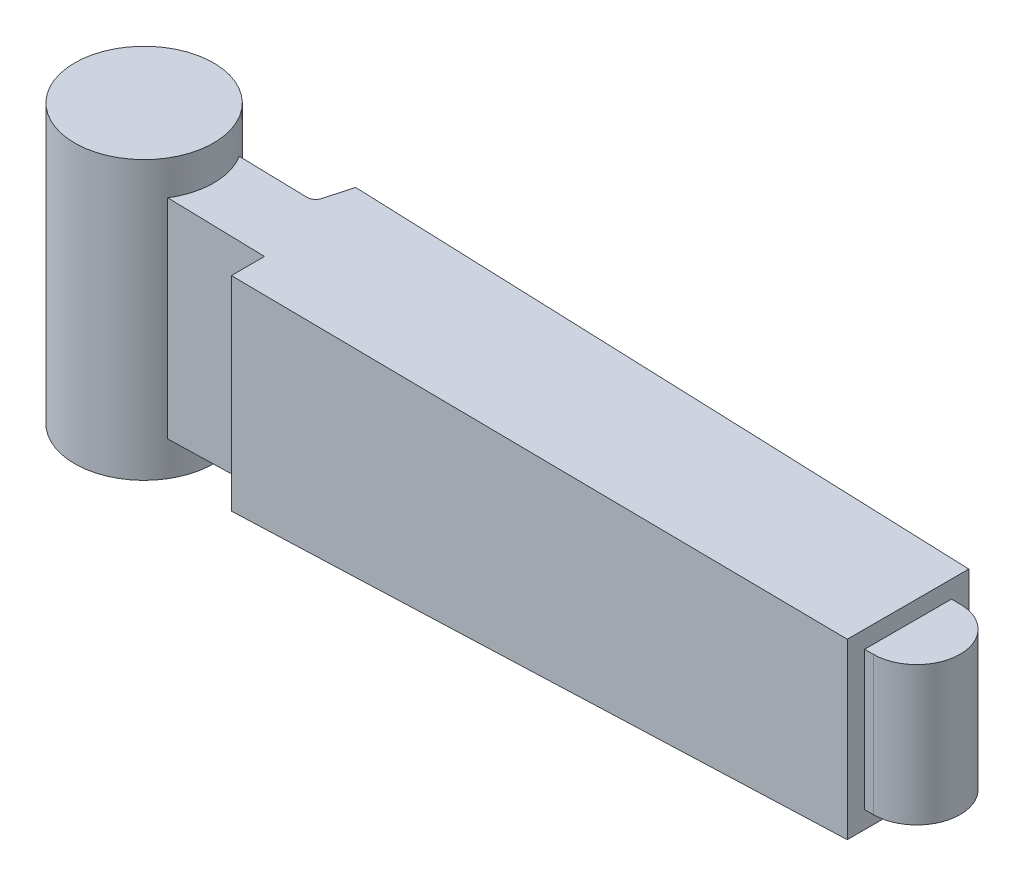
ISO-10303-21;
HEADER;
FILE_DESCRIPTION(('STEP AP214'),'2;1');
FILE_NAME('part.step','',(''),(''),'','','');
FILE_SCHEMA(('AUTOMOTIVE_DESIGN { 1 0 10303 214 1 1 1 1 }'));
ENDSEC;
DATA;
#1=APPLICATION_CONTEXT('core data for automotive mechanical design processes');
#2=APPLICATION_PROTOCOL_DEFINITION('international standard','automotive_design',2000,#1);
#3=PRODUCT_CONTEXT('',#1,'mechanical');
#4=PRODUCT('Part','Part','',(#3));
#5=PRODUCT_RELATED_PRODUCT_CATEGORY('part','',(#4));
#6=PRODUCT_DEFINITION_FORMATION('','',#4);
#7=PRODUCT_DEFINITION_CONTEXT('part definition',#1,'design');
#8=PRODUCT_DEFINITION('design','',#6,#7);
#9=PRODUCT_DEFINITION_SHAPE('','',#8);
#10=(LENGTH_UNIT() NAMED_UNIT(*) SI_UNIT(.MILLI.,.METRE.));
#11=(NAMED_UNIT(*) PLANE_ANGLE_UNIT() SI_UNIT($,.RADIAN.));
#12=(NAMED_UNIT(*) SI_UNIT($,.STERADIAN.) SOLID_ANGLE_UNIT());
#13=UNCERTAINTY_MEASURE_WITH_UNIT(LENGTH_MEASURE(1.E-05),#10,'distance_accuracy_value','');
#14=(GEOMETRIC_REPRESENTATION_CONTEXT(3) GLOBAL_UNCERTAINTY_ASSIGNED_CONTEXT((#13)) GLOBAL_UNIT_ASSIGNED_CONTEXT((#10,
#11,#12)) REPRESENTATION_CONTEXT('',''));
#15=CARTESIAN_POINT('',(0.,0.,0.));
#16=DIRECTION('',(0.,0.,1.));
#17=DIRECTION('',(1.,0.,0.));
#18=AXIS2_PLACEMENT_3D('',#15,#16,#17);
#19=CARTESIAN_POINT('',(44.,5.,-4.065));
#20=DIRECTION('',(-1.,0.,0.));
#21=DIRECTION('',(0.,0.,1.));
#22=AXIS2_PLACEMENT_3D('',#19,#20,#21);
#23=PLANE('',#22);
#24=DIRECTION('',(0.,0.,1.));
#25=VECTOR('',#24,1.);
#26=CARTESIAN_POINT('',(44.,5.,-4.065));
#27=LINE('',#26,#25);
#28=CARTESIAN_POINT('',(44.,5.,-3.5));
#29=VERTEX_POINT('',#28);
#30=CARTESIAN_POINT('',(44.,5.,3.5));
#31=VERTEX_POINT('',#30);
#32=EDGE_CURVE('E186',#29,#31,#27,.T.);
#33=ORIENTED_EDGE('',*,*,#32,.T.);
#34=DIRECTION('',(0.,1.,0.));
#35=VECTOR('',#34,1.);
#36=CARTESIAN_POINT('',(44.,-9.065,3.5));
#37=LINE('',#36,#35);
#38=CARTESIAN_POINT('',(44.,-5.,3.5));
#39=VERTEX_POINT('',#38);
#40=EDGE_CURVE('E225',#39,#31,#37,.T.);
#41=ORIENTED_EDGE('',*,*,#40,.F.);
#42=DIRECTION('',(0.,0.,1.));
#43=VECTOR('',#42,1.);
#44=CARTESIAN_POINT('',(44.,-5.,-4.065));
#45=LINE('',#44,#43);
#46=CARTESIAN_POINT('',(44.,-5.,-3.5));
#47=VERTEX_POINT('',#46);
#48=EDGE_CURVE('E183',#47,#39,#45,.T.);
#49=ORIENTED_EDGE('',*,*,#48,.F.);
#50=DIRECTION('',(0.,1.,0.));
#51=VECTOR('',#50,1.);
#52=CARTESIAN_POINT('',(44.,-9.065,-3.5));
#53=LINE('',#52,#51);
#54=EDGE_CURVE('E222',#47,#29,#53,.T.);
#55=ORIENTED_EDGE('',*,*,#54,.T.);
#56=EDGE_LOOP('',(#33,#41,#49,#55));
#57=FACE_BOUND('',#56,.T.);
#58=DIRECTION('',(0.,-1.,0.));
#59=VECTOR('',#58,1.);
#60=CARTESIAN_POINT('',(44.,4.,2.5));
#61=LINE('',#60,#59);
#62=CARTESIAN_POINT('',(44.,4.,2.5));
#63=VERTEX_POINT('',#62);
#64=CARTESIAN_POINT('',(44.,-4.,2.5));
#65=VERTEX_POINT('',#64);
#66=EDGE_CURVE('E241',#63,#65,#61,.T.);
#67=ORIENTED_EDGE('',*,*,#66,.F.);
#68=DIRECTION('',(0.,0.,1.));
#69=VECTOR('',#68,1.);
#70=CARTESIAN_POINT('',(44.,4.,-2.5));
#71=LINE('',#70,#69);
#72=CARTESIAN_POINT('',(44.,4.,-2.5));
#73=VERTEX_POINT('',#72);
#74=EDGE_CURVE('E259',#73,#63,#71,.T.);
#75=ORIENTED_EDGE('',*,*,#74,.F.);
#76=DIRECTION('',(0.,-1.,0.));
#77=VECTOR('',#76,1.);
#78=CARTESIAN_POINT('',(44.,4.,-2.5));
#79=LINE('',#78,#77);
#80=CARTESIAN_POINT('',(44.,-4.,-2.5));
#81=VERTEX_POINT('',#80);
#82=EDGE_CURVE('E247',#73,#81,#79,.T.);
#83=ORIENTED_EDGE('',*,*,#82,.T.);
#84=DIRECTION('',(0.,0.,1.));
#85=VECTOR('',#84,1.);
#86=CARTESIAN_POINT('',(44.,-4.,-2.5));
#87=LINE('',#86,#85);
#88=EDGE_CURVE('E267',#81,#65,#87,.T.);
#89=ORIENTED_EDGE('',*,*,#88,.T.);
#90=EDGE_LOOP('',(#67,#75,#83,#89));
#91=FACE_BOUND('',#90,.T.);
#92=ADVANCED_FACE('F14',(#57,#91),#23,.F.);
#93=CARTESIAN_POINT('',(2.,-9.065,-2.065));
#94=DIRECTION('',(0.,0.,1.));
#95=DIRECTION('',(1.,0.,0.));
#96=AXIS2_PLACEMENT_3D('',#93,#94,#95);
#97=PLANE('',#96);
#98=DIRECTION('',(0.,1.,0.));
#99=VECTOR('',#98,1.);
#100=CARTESIAN_POINT('',(3.42575174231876,13.2728062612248,-2.065));
#101=LINE('',#100,#99);
#102=CARTESIAN_POINT('',(3.42575174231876,6.01435620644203,-2.065));
#103=VERTEX_POINT('',#102);
#104=CARTESIAN_POINT('',(3.42575174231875,-6.01435620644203,-2.065));
#105=VERTEX_POINT('',#104);
#106=EDGE_CURVE('E228',#103,#105,#101,.F.);
#107=ORIENTED_EDGE('',*,*,#106,.F.);
#108=DIRECTION('',(-0.999687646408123,0.024992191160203,0.));
#109=VECTOR('',#108,1.);
#110=CARTESIAN_POINT('',(2.,6.05,-2.065));
#111=LINE('',#110,#109);
#112=CARTESIAN_POINT('',(7.30278635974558,5.91743034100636,-2.065));
#113=VERTEX_POINT('',#112);
#114=EDGE_CURVE('E172',#113,#103,#111,.T.);
#115=ORIENTED_EDGE('',*,*,#114,.F.);
#116=DIRECTION('',(0.,1.,0.));
#117=VECTOR('',#116,1.);
#118=CARTESIAN_POINT('',(7.30278635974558,-9.065,-2.065));
#119=LINE('',#118,#117);
#120=CARTESIAN_POINT('',(7.30278635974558,-5.91743034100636,-2.065));
#121=VERTEX_POINT('',#120);
#122=EDGE_CURVE('E213',#121,#113,#119,.T.);
#123=ORIENTED_EDGE('',*,*,#122,.F.);
#124=DIRECTION('',(-0.999687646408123,-0.024992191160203,0.));
#125=VECTOR('',#124,1.);
#126=CARTESIAN_POINT('',(2.,-6.05,-2.065));
#127=LINE('',#126,#125);
#128=EDGE_CURVE('E197',#121,#105,#127,.T.);
#129=ORIENTED_EDGE('',*,*,#128,.T.);
#130=EDGE_LOOP('',(#107,#115,#123,#129));
#131=FACE_BOUND('',#130,.T.);
#132=ADVANCED_FACE('F299',(#131),#97,.F.);
#133=CARTESIAN_POINT('',(2.,-6.05,-4.065));
#134=DIRECTION('',(0.024992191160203,-0.999687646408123,0.));
#135=DIRECTION('',(0.999687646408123,0.024992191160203,0.));
#136=AXIS2_PLACEMENT_3D('',#133,#134,#135);
#137=PLANE('',#136);
#138=DIRECTION('',(-0.999687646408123,-0.024992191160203,0.));
#139=VECTOR('',#138,1.);
#140=CARTESIAN_POINT('',(2.,-6.05,2.065));
#141=LINE('',#140,#139);
#142=CARTESIAN_POINT('',(9.,-5.875,2.065));
#143=VERTEX_POINT('',#142);
#144=CARTESIAN_POINT('',(3.42575174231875,-6.01435620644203,2.065));
#145=VERTEX_POINT('',#144);
#146=EDGE_CURVE('E194',#143,#145,#141,.T.);
#147=ORIENTED_EDGE('',*,*,#146,.T.);
#148=CARTESIAN_POINT('',(0.,-6.1,0.));
#149=DIRECTION('',(0.024992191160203,-0.999687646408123,0.));
#150=DIRECTION('',(0.999687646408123,0.024992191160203,0.));
#151=AXIS2_PLACEMENT_3D('',#148,#149,#150);
#152=ELLIPSE('',#151,4.00124980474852,4.);
#153=EDGE_CURVE('E230',#145,#105,#152,.F.);
#154=ORIENTED_EDGE('',*,*,#153,.T.);
#155=ORIENTED_EDGE('',*,*,#128,.F.);
#156=CARTESIAN_POINT('',(7.30278635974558,-5.91743034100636,-2.565));
#157=DIRECTION('',(0.024992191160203,-0.999687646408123,0.));
#158=DIRECTION('',(0.999687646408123,0.024992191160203,0.));
#159=AXIS2_PLACEMENT_3D('',#156,#157,#158);
#160=ELLIPSE('',#159,0.500156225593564,0.5);
#161=CARTESIAN_POINT('',(7.78574927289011,-5.90535626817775,-2.43559047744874));
#162=VERTEX_POINT('',#161);
#163=EDGE_CURVE('E200',#121,#162,#160,.F.);
#164=ORIENTED_EDGE('',*,*,#163,.T.);
#165=DIRECTION('',(-0.258813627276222,-0.00647034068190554,0.96590560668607));
#166=VECTOR('',#165,1.);
#167=CARTESIAN_POINT('',(7.8052868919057,-5.90486782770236,-2.50850586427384));
#168=LINE('',#167,#166);
#169=CARTESIAN_POINT('',(8.2,-5.895,-3.98159523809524));
#170=VERTEX_POINT('',#169);
#171=EDGE_CURVE('E202',#170,#162,#168,.T.);
#172=ORIENTED_EDGE('',*,*,#171,.F.);
#173=DIRECTION('',(0.999597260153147,0.0249899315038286,0.0134469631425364));
#174=VECTOR('',#173,1.);
#175=CARTESIAN_POINT('',(2.,-6.05,-4.065));
#176=LINE('',#175,#174);
#177=EDGE_CURVE('E205',#170,#47,#176,.T.);
#178=ORIENTED_EDGE('',*,*,#177,.T.);
#179=ORIENTED_EDGE('',*,*,#48,.T.);
#180=DIRECTION('',(0.999597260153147,0.0249899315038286,-0.0134469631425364));
#181=VECTOR('',#180,1.);
#182=CARTESIAN_POINT('',(2.10927978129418,-6.04726800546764,4.06352992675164));
#183=LINE('',#182,#181);
#184=CARTESIAN_POINT('',(9.,-5.875,3.97083333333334));
#185=VERTEX_POINT('',#184);
#186=EDGE_CURVE('E189',#185,#39,#183,.T.);
#187=ORIENTED_EDGE('',*,*,#186,.F.);
#188=DIRECTION('',(0.,0.,-1.));
#189=VECTOR('',#188,1.);
#190=CARTESIAN_POINT('',(9.,-5.875,-4.065));
#191=LINE('',#190,#189);
#192=EDGE_CURVE('E192',#185,#143,#191,.T.);
#193=ORIENTED_EDGE('',*,*,#192,.T.);
#194=EDGE_LOOP('',(#147,#154,#155,#164,#172,#178,#179,#187,#193));
#195=FACE_BOUND('',#194,.T.);
#196=ADVANCED_FACE('F16',(#195),#137,.T.);
#197=CARTESIAN_POINT('',(2.,6.05,-4.065));
#198=DIRECTION('',(-0.024992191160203,-0.999687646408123,0.));
#199=DIRECTION('',(0.999687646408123,-0.024992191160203,0.));
#200=AXIS2_PLACEMENT_3D('',#197,#198,#199);
#201=PLANE('',#200);
#202=CARTESIAN_POINT('',(0.,6.1,0.));
#203=DIRECTION('',(-0.024992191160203,-0.999687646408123,0.));
#204=DIRECTION('',(-0.999687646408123,0.024992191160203,0.));
#205=AXIS2_PLACEMENT_3D('',#202,#203,#204);
#206=ELLIPSE('',#205,4.00124980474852,4.);
#207=CARTESIAN_POINT('',(3.42575174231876,6.01435620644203,2.065));
#208=VERTEX_POINT('',#207);
#209=EDGE_CURVE('E233',#208,#103,#206,.F.);
#210=ORIENTED_EDGE('',*,*,#209,.F.);
#211=DIRECTION('',(-0.999687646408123,0.024992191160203,0.));
#212=VECTOR('',#211,1.);
#213=CARTESIAN_POINT('',(2.,6.05,2.065));
#214=LINE('',#213,#212);
#215=CARTESIAN_POINT('',(9.,5.875,2.065));
#216=VERTEX_POINT('',#215);
#217=EDGE_CURVE('E169',#216,#208,#214,.T.);
#218=ORIENTED_EDGE('',*,*,#217,.F.);
#219=DIRECTION('',(0.,0.,-1.));
#220=VECTOR('',#219,1.);
#221=CARTESIAN_POINT('',(9.,5.875,-4.065));
#222=LINE('',#221,#220);
#223=CARTESIAN_POINT('',(9.,5.875,3.97083333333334));
#224=VERTEX_POINT('',#223);
#225=EDGE_CURVE('E166',#224,#216,#222,.T.);
#226=ORIENTED_EDGE('',*,*,#225,.F.);
#227=DIRECTION('',(0.999597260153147,-0.0249899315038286,-0.0134469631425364));
#228=VECTOR('',#227,1.);
#229=CARTESIAN_POINT('',(2.10927978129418,6.04726800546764,4.06352992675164));
#230=LINE('',#229,#228);
#231=EDGE_CURVE('E164',#224,#31,#230,.T.);
#232=ORIENTED_EDGE('',*,*,#231,.T.);
#233=ORIENTED_EDGE('',*,*,#32,.F.);
#234=DIRECTION('',(0.999597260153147,-0.0249899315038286,0.0134469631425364));
#235=VECTOR('',#234,1.);
#236=CARTESIAN_POINT('',(2.,6.05,-4.065));
#237=LINE('',#236,#235);
#238=CARTESIAN_POINT('',(8.2,5.895,-3.98159523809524));
#239=VERTEX_POINT('',#238);
#240=EDGE_CURVE('E180',#239,#29,#237,.T.);
#241=ORIENTED_EDGE('',*,*,#240,.F.);
#242=DIRECTION('',(-0.258813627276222,0.00647034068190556,0.96590560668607));
#243=VECTOR('',#242,1.);
#244=CARTESIAN_POINT('',(7.8052868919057,5.90486782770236,-2.50850586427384));
#245=LINE('',#244,#243);
#246=CARTESIAN_POINT('',(7.78574927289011,5.90535626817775,-2.43559047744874));
#247=VERTEX_POINT('',#246);
#248=EDGE_CURVE('E178',#239,#247,#245,.T.);
#249=ORIENTED_EDGE('',*,*,#248,.T.);
#250=CARTESIAN_POINT('',(7.30278635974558,5.91743034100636,-2.565));
#251=DIRECTION('',(-0.024992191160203,-0.999687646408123,0.));
#252=DIRECTION('',(-0.999687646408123,0.024992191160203,0.));
#253=AXIS2_PLACEMENT_3D('',#250,#251,#252);
#254=ELLIPSE('',#253,0.500156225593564,0.5);
#255=EDGE_CURVE('E175',#113,#247,#254,.F.);
#256=ORIENTED_EDGE('',*,*,#255,.F.);
#257=ORIENTED_EDGE('',*,*,#114,.T.);
#258=EDGE_LOOP('',(#210,#218,#226,#232,#233,#241,#249,#256,#257));
#259=FACE_BOUND('',#258,.T.);
#260=ADVANCED_FACE('F312',(#259),#201,.F.);
#261=CARTESIAN_POINT('',(2.,-9.065,2.065));
#262=DIRECTION('',(0.,0.,1.));
#263=DIRECTION('',(1.,0.,0.));
#264=AXIS2_PLACEMENT_3D('',#261,#262,#263);
#265=PLANE('',#264);
#266=ORIENTED_EDGE('',*,*,#217,.T.);
#267=DIRECTION('',(0.,1.,0.));
#268=VECTOR('',#267,1.);
#269=CARTESIAN_POINT('',(3.42575174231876,13.2728062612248,2.065));
#270=LINE('',#269,#268);
#271=EDGE_CURVE('E161',#208,#145,#270,.F.);
#272=ORIENTED_EDGE('',*,*,#271,.T.);
#273=ORIENTED_EDGE('',*,*,#146,.F.);
#274=DIRECTION('',(0.,1.,0.));
#275=VECTOR('',#274,1.);
#276=CARTESIAN_POINT('',(9.,-9.065,2.065));
#277=LINE('',#276,#275);
#278=EDGE_CURVE('E210',#143,#216,#277,.T.);
#279=ORIENTED_EDGE('',*,*,#278,.T.);
#280=EDGE_LOOP('',(#266,#272,#273,#279));
#281=FACE_BOUND('',#280,.T.);
#282=ADVANCED_FACE('F314',(#281),#265,.T.);
#283=CARTESIAN_POINT('',(44.,-9.065,-3.5));
#284=DIRECTION('',(0.0134511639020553,0.,-0.999909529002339));
#285=DIRECTION('',(-0.999909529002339,0.,-0.0134511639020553));
#286=AXIS2_PLACEMENT_3D('',#283,#284,#285);
#287=PLANE('',#286);
#288=ORIENTED_EDGE('',*,*,#177,.F.);
#289=DIRECTION('',(0.,1.,0.));
#290=VECTOR('',#289,1.);
#291=CARTESIAN_POINT('',(8.2,-9.065,-3.98159523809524));
#292=LINE('',#291,#290);
#293=EDGE_CURVE('E219',#170,#239,#292,.T.);
#294=ORIENTED_EDGE('',*,*,#293,.T.);
#295=ORIENTED_EDGE('',*,*,#240,.T.);
#296=ORIENTED_EDGE('',*,*,#54,.F.);
#297=EDGE_LOOP('',(#288,#294,#295,#296));
#298=FACE_BOUND('',#297,.T.);
#299=ADVANCED_FACE('F321',(#298),#287,.T.);
#300=CARTESIAN_POINT('',(7.78574927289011,-9.065,-2.43559047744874));
#301=DIRECTION('',(0.965925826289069,0.,0.258819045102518));
#302=DIRECTION('',(0.258819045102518,0.,-0.965925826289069));
#303=AXIS2_PLACEMENT_3D('',#300,#301,#302);
#304=PLANE('',#303);
#305=ORIENTED_EDGE('',*,*,#293,.F.);
#306=ORIENTED_EDGE('',*,*,#171,.T.);
#307=DIRECTION('',(0.,1.,0.));
#308=VECTOR('',#307,1.);
#309=CARTESIAN_POINT('',(7.78574927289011,-9.065,-2.43559047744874));
#310=LINE('',#309,#308);
#311=EDGE_CURVE('E216',#162,#247,#310,.T.);
#312=ORIENTED_EDGE('',*,*,#311,.T.);
#313=ORIENTED_EDGE('',*,*,#248,.F.);
#314=EDGE_LOOP('',(#305,#306,#312,#313));
#315=FACE_BOUND('',#314,.T.);
#316=ADVANCED_FACE('F343',(#315),#304,.F.);
#317=CARTESIAN_POINT('',(7.30278635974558,-9.065,-2.565));
#318=DIRECTION('',(0.,1.,0.));
#319=DIRECTION('',(0.,0.,1.));
#320=AXIS2_PLACEMENT_3D('',#317,#318,#319);
#321=CYLINDRICAL_SURFACE('',#320,0.5);
#322=ORIENTED_EDGE('',*,*,#163,.F.);
#323=ORIENTED_EDGE('',*,*,#122,.T.);
#324=ORIENTED_EDGE('',*,*,#255,.T.);
#325=ORIENTED_EDGE('',*,*,#311,.F.);
#326=EDGE_LOOP('',(#322,#323,#324,#325));
#327=FACE_BOUND('',#326,.T.);
#328=ADVANCED_FACE('F347',(#327),#321,.F.);
#329=CARTESIAN_POINT('',(44.,-9.065,3.5));
#330=DIRECTION('',(-0.0134511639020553,0.,-0.999909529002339));
#331=DIRECTION('',(-0.999909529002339,0.,0.0134511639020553));
#332=AXIS2_PLACEMENT_3D('',#329,#330,#331);
#333=PLANE('',#332);
#334=DIRECTION('',(0.,1.,0.));
#335=VECTOR('',#334,1.);
#336=CARTESIAN_POINT('',(9.,-9.065,3.97083333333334));
#337=LINE('',#336,#335);
#338=EDGE_CURVE('E207',#185,#224,#337,.T.);
#339=ORIENTED_EDGE('',*,*,#338,.F.);
#340=ORIENTED_EDGE('',*,*,#186,.T.);
#341=ORIENTED_EDGE('',*,*,#40,.T.);
#342=ORIENTED_EDGE('',*,*,#231,.F.);
#343=EDGE_LOOP('',(#339,#340,#341,#342));
#344=FACE_BOUND('',#343,.T.);
#345=ADVANCED_FACE('F335',(#344),#333,.F.);
#346=CARTESIAN_POINT('',(9.,-9.065,2.065));
#347=DIRECTION('',(-1.,0.,0.));
#348=DIRECTION('',(0.,0.,1.));
#349=AXIS2_PLACEMENT_3D('',#346,#347,#348);
#350=PLANE('',#349);
#351=ORIENTED_EDGE('',*,*,#192,.F.);
#352=ORIENTED_EDGE('',*,*,#338,.T.);
#353=ORIENTED_EDGE('',*,*,#225,.T.);
#354=ORIENTED_EDGE('',*,*,#278,.F.);
#355=EDGE_LOOP('',(#351,#352,#353,#354));
#356=FACE_BOUND('',#355,.T.);
#357=ADVANCED_FACE('F310',(#356),#350,.T.);
#358=CARTESIAN_POINT('',(0.,13.2728062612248,0.));
#359=DIRECTION('',(0.,1.,0.));
#360=DIRECTION('',(-1.,0.,0.));
#361=AXIS2_PLACEMENT_3D('',#358,#359,#360);
#362=CYLINDRICAL_SURFACE('',#361,4.);
#363=DIRECTION('',(0.,1.,0.));
#364=VECTOR('',#363,1.);
#365=CARTESIAN_POINT('',(-3.,13.2728062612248,2.64575131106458));
#366=LINE('',#365,#364);
#367=CARTESIAN_POINT('',(-3.,-4.,2.64575131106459));
#368=VERTEX_POINT('',#367);
#369=CARTESIAN_POINT('',(-3.,4.,2.64575131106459));
#370=VERTEX_POINT('',#369);
#371=EDGE_CURVE('E18',#368,#370,#366,.T.);
#372=ORIENTED_EDGE('',*,*,#371,.F.);
#373=CARTESIAN_POINT('',(0.,-4.,0.));
#374=DIRECTION('',(0.,-1.,0.));
#375=DIRECTION('',(0.,0.,-1.));
#376=AXIS2_PLACEMENT_3D('',#373,#374,#375);
#377=CIRCLE('',#376,4.);
#378=CARTESIAN_POINT('',(-3.,-4.,-2.64575131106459));
#379=VERTEX_POINT('',#378);
#380=EDGE_CURVE('E9',#368,#379,#377,.T.);
#381=ORIENTED_EDGE('',*,*,#380,.T.);
#382=DIRECTION('',(0.,1.,0.));
#383=VECTOR('',#382,1.);
#384=CARTESIAN_POINT('',(-3.,13.2728062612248,-2.64575131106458));
#385=LINE('',#384,#383);
#386=CARTESIAN_POINT('',(-3.,4.,-2.64575131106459));
#387=VERTEX_POINT('',#386);
#388=EDGE_CURVE('E143',#387,#379,#385,.F.);
#389=ORIENTED_EDGE('',*,*,#388,.F.);
#390=CARTESIAN_POINT('',(0.,4.,0.));
#391=DIRECTION('',(0.,-1.,0.));
#392=DIRECTION('',(0.,0.,-1.));
#393=AXIS2_PLACEMENT_3D('',#390,#391,#392);
#394=CIRCLE('',#393,4.);
#395=EDGE_CURVE('E135',#370,#387,#394,.T.);
#396=ORIENTED_EDGE('',*,*,#395,.F.);
#397=EDGE_LOOP('',(#372,#381,#389,#396));
#398=FACE_BOUND('',#397,.T.);
#399=CARTESIAN_POINT('',(-2.08461187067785,-4.,-3.41385315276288));
#400=VERTEX_POINT('',#399);
#401=CARTESIAN_POINT('',(3.12650093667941,-4.,-2.49499336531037));
#402=VERTEX_POINT('',#401);
#403=EDGE_CURVE('E24',#400,#402,#377,.T.);
#404=ORIENTED_EDGE('',*,*,#403,.T.);
#405=DIRECTION('',(0.,1.,0.));
#406=VECTOR('',#405,1.);
#407=CARTESIAN_POINT('',(3.12650093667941,13.2728062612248,-2.49499336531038));
#408=LINE('',#407,#406);
#409=CARTESIAN_POINT('',(3.12650093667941,4.,-2.49499336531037));
#410=VERTEX_POINT('',#409);
#411=EDGE_CURVE('E155',#402,#410,#408,.T.);
#412=ORIENTED_EDGE('',*,*,#411,.T.);
#413=CARTESIAN_POINT('',(-2.08461187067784,4.,-3.41385315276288));
#414=VERTEX_POINT('',#413);
#415=EDGE_CURVE('E145',#414,#410,#394,.T.);
#416=ORIENTED_EDGE('',*,*,#415,.F.);
#417=DIRECTION('',(0.,1.,0.));
#418=VECTOR('',#417,1.);
#419=CARTESIAN_POINT('',(-2.08461187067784,13.2728062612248,-3.41385315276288));
#420=LINE('',#419,#418);
#421=EDGE_CURVE('E158',#414,#400,#420,.F.);
#422=ORIENTED_EDGE('',*,*,#421,.T.);
#423=EDGE_LOOP('',(#404,#412,#416,#422));
#424=FACE_BOUND('',#423,.T.);
#425=CARTESIAN_POINT('',(0.,-8.,0.));
#426=DIRECTION('',(0.,1.,0.));
#427=DIRECTION('',(-1.,0.,0.));
#428=AXIS2_PLACEMENT_3D('',#425,#426,#427);
#429=CIRCLE('',#428,4.);
#430=CARTESIAN_POINT('',(-4.,-8.,0.));
#431=VERTEX_POINT('',#430);
#432=EDGE_CURVE('E238',#431,#431,#429,.T.);
#433=ORIENTED_EDGE('',*,*,#432,.T.);
#434=EDGE_LOOP('',(#433));
#435=FACE_BOUND('',#434,.T.);
#436=CARTESIAN_POINT('',(0.,8.,0.));
#437=DIRECTION('',(0.,1.,0.));
#438=DIRECTION('',(-1.,0.,0.));
#439=AXIS2_PLACEMENT_3D('',#436,#437,#438);
#440=CIRCLE('',#439,4.);
#441=CARTESIAN_POINT('',(-4.,8.,0.));
#442=VERTEX_POINT('',#441);
#443=EDGE_CURVE('E235',#442,#442,#440,.T.);
#444=ORIENTED_EDGE('',*,*,#443,.F.);
#445=EDGE_LOOP('',(#444));
#446=FACE_BOUND('',#445,.T.);
#447=ORIENTED_EDGE('',*,*,#209,.T.);
#448=ORIENTED_EDGE('',*,*,#106,.T.);
#449=ORIENTED_EDGE('',*,*,#153,.F.);
#450=ORIENTED_EDGE('',*,*,#271,.F.);
#451=EDGE_LOOP('',(#447,#448,#449,#450));
#452=FACE_BOUND('',#451,.T.);
#453=ADVANCED_FACE('F152',(#398,#424,#435,#446,#452),#362,.T.);
#454=CARTESIAN_POINT('',(0.,8.,0.));
#455=DIRECTION('',(0.,1.,0.));
#456=DIRECTION('',(-1.,0.,0.));
#457=AXIS2_PLACEMENT_3D('',#454,#455,#456);
#458=PLANE('',#457);
#459=ORIENTED_EDGE('',*,*,#443,.T.);
#460=EDGE_LOOP('',(#459));
#461=FACE_BOUND('',#460,.T.);
#462=ADVANCED_FACE('F350',(#461),#458,.T.);
#463=CARTESIAN_POINT('',(4.,-8.,0.));
#464=DIRECTION('',(0.,-1.,0.));
#465=DIRECTION('',(1.,0.,0.));
#466=AXIS2_PLACEMENT_3D('',#463,#464,#465);
#467=PLANE('',#466);
#468=ORIENTED_EDGE('',*,*,#432,.F.);
#469=EDGE_LOOP('',(#468));
#470=FACE_BOUND('',#469,.T.);
#471=ADVANCED_FACE('F357',(#470),#467,.T.);
#472=CARTESIAN_POINT('',(44.,4.,2.5));
#473=DIRECTION('',(0.,0.,-1.));
#474=DIRECTION('',(-1.,0.,0.));
#475=AXIS2_PLACEMENT_3D('',#472,#473,#474);
#476=PLANE('',#475);
#477=DIRECTION('',(0.,-1.,0.));
#478=VECTOR('',#477,1.);
#479=CARTESIAN_POINT('',(44.5,4.,2.5));
#480=LINE('',#479,#478);
#481=CARTESIAN_POINT('',(44.5,4.,2.5));
#482=VERTEX_POINT('',#481);
#483=CARTESIAN_POINT('',(44.5,-4.,2.5));
#484=VERTEX_POINT('',#483);
#485=EDGE_CURVE('E243',#482,#484,#480,.T.);
#486=ORIENTED_EDGE('',*,*,#485,.F.);
#487=DIRECTION('',(1.,0.,0.));
#488=VECTOR('',#487,1.);
#489=CARTESIAN_POINT('',(44.,4.,2.5));
#490=LINE('',#489,#488);
#491=EDGE_CURVE('E256',#63,#482,#490,.T.);
#492=ORIENTED_EDGE('',*,*,#491,.F.);
#493=ORIENTED_EDGE('',*,*,#66,.T.);
#494=DIRECTION('',(1.,0.,0.));
#495=VECTOR('',#494,1.);
#496=CARTESIAN_POINT('',(44.,-4.,2.5));
#497=LINE('',#496,#495);
#498=EDGE_CURVE('E38',#65,#484,#497,.T.);
#499=ORIENTED_EDGE('',*,*,#498,.T.);
#500=EDGE_LOOP('',(#486,#492,#493,#499));
#501=FACE_BOUND('',#500,.T.);
#502=ADVANCED_FACE('F503',(#501),#476,.F.);
#503=CARTESIAN_POINT('',(44.5,4.,0.));
#504=DIRECTION('',(0.,-1.,0.));
#505=DIRECTION('',(0.,0.,-1.));
#506=AXIS2_PLACEMENT_3D('',#503,#504,#505);
#507=CYLINDRICAL_SURFACE('',#506,2.5);
#508=DIRECTION('',(0.,-1.,0.));
#509=VECTOR('',#508,1.);
#510=CARTESIAN_POINT('',(44.5,4.,-2.5));
#511=LINE('',#510,#509);
#512=CARTESIAN_POINT('',(44.5,4.,-2.5));
#513=VERTEX_POINT('',#512);
#514=CARTESIAN_POINT('',(44.5,-4.,-2.5));
#515=VERTEX_POINT('',#514);
#516=EDGE_CURVE('E245',#513,#515,#511,.T.);
#517=ORIENTED_EDGE('',*,*,#516,.F.);
#518=CARTESIAN_POINT('',(44.5,4.,0.));
#519=DIRECTION('',(0.,-1.,0.));
#520=DIRECTION('',(0.,0.,-1.));
#521=AXIS2_PLACEMENT_3D('',#518,#519,#520);
#522=CIRCLE('',#521,2.5);
#523=EDGE_CURVE('E253',#513,#482,#522,.T.);
#524=ORIENTED_EDGE('',*,*,#523,.T.);
#525=ORIENTED_EDGE('',*,*,#485,.T.);
#526=CARTESIAN_POINT('',(44.5,-4.,0.));
#527=DIRECTION('',(0.,-1.,0.));
#528=DIRECTION('',(0.,0.,-1.));
#529=AXIS2_PLACEMENT_3D('',#526,#527,#528);
#530=CIRCLE('',#529,2.5);
#531=EDGE_CURVE('E264',#515,#484,#530,.T.);
#532=ORIENTED_EDGE('',*,*,#531,.F.);
#533=EDGE_LOOP('',(#517,#524,#525,#532));
#534=FACE_BOUND('',#533,.T.);
#535=ADVANCED_FACE('F486',(#534),#507,.T.);
#536=CARTESIAN_POINT('',(44.,4.,-2.5));
#537=DIRECTION('',(0.,0.,-1.));
#538=DIRECTION('',(-1.,0.,0.));
#539=AXIS2_PLACEMENT_3D('',#536,#537,#538);
#540=PLANE('',#539);
#541=DIRECTION('',(1.,0.,0.));
#542=VECTOR('',#541,1.);
#543=CARTESIAN_POINT('',(44.,4.,-2.5));
#544=LINE('',#543,#542);
#545=EDGE_CURVE('E250',#73,#513,#544,.T.);
#546=ORIENTED_EDGE('',*,*,#545,.T.);
#547=ORIENTED_EDGE('',*,*,#516,.T.);
#548=DIRECTION('',(1.,0.,0.));
#549=VECTOR('',#548,1.);
#550=CARTESIAN_POINT('',(44.,-4.,-2.5));
#551=LINE('',#550,#549);
#552=EDGE_CURVE('E261',#81,#515,#551,.T.);
#553=ORIENTED_EDGE('',*,*,#552,.F.);
#554=ORIENTED_EDGE('',*,*,#82,.F.);
#555=EDGE_LOOP('',(#546,#547,#553,#554));
#556=FACE_BOUND('',#555,.T.);
#557=ADVANCED_FACE('F476',(#556),#540,.T.);
#558=CARTESIAN_POINT('',(44.5,4.,0.));
#559=DIRECTION('',(0.,-1.,0.));
#560=DIRECTION('',(0.,0.,-1.));
#561=AXIS2_PLACEMENT_3D('',#558,#559,#560);
#562=PLANE('',#561);
#563=ORIENTED_EDGE('',*,*,#74,.T.);
#564=ORIENTED_EDGE('',*,*,#491,.T.);
#565=ORIENTED_EDGE('',*,*,#523,.F.);
#566=ORIENTED_EDGE('',*,*,#545,.F.);
#567=EDGE_LOOP('',(#563,#564,#565,#566));
#568=FACE_BOUND('',#567,.T.);
#569=ADVANCED_FACE('F474',(#568),#562,.F.);
#570=CARTESIAN_POINT('',(44.5,-4.,0.));
#571=DIRECTION('',(0.,-1.,0.));
#572=DIRECTION('',(0.,0.,-1.));
#573=AXIS2_PLACEMENT_3D('',#570,#571,#572);
#574=PLANE('',#573);
#575=ORIENTED_EDGE('',*,*,#88,.F.);
#576=ORIENTED_EDGE('',*,*,#552,.T.);
#577=ORIENTED_EDGE('',*,*,#531,.T.);
#578=ORIENTED_EDGE('',*,*,#498,.F.);
#579=EDGE_LOOP('',(#575,#576,#577,#578));
#580=FACE_BOUND('',#579,.T.);
#581=ADVANCED_FACE('F293',(#580),#574,.T.);
#582=CARTESIAN_POINT('',(-4.,4.,3.5));
#583=DIRECTION('',(0.,-1.,0.));
#584=DIRECTION('',(0.,0.,-1.));
#585=AXIS2_PLACEMENT_3D('',#582,#583,#584);
#586=PLANE('',#585);
#587=ORIENTED_EDGE('',*,*,#415,.T.);
#588=DIRECTION('',(0.984807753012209,0.,0.173648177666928));
#589=VECTOR('',#588,1.);
#590=CARTESIAN_POINT('',(-3.,4.,-3.57526077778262));
#591=LINE('',#590,#589);
#592=EDGE_CURVE('E30',#414,#410,#591,.T.);
#593=ORIENTED_EDGE('',*,*,#592,.F.);
#594=EDGE_LOOP('',(#587,#593));
#595=FACE_BOUND('',#594,.T.);
#596=ADVANCED_FACE('F283',(#595),#586,.T.);
#597=CARTESIAN_POINT('',(-4.,-4.,3.5));
#598=DIRECTION('',(0.,-1.,0.));
#599=DIRECTION('',(0.,0.,-1.));
#600=AXIS2_PLACEMENT_3D('',#597,#598,#599);
#601=PLANE('',#600);
#602=ORIENTED_EDGE('',*,*,#403,.F.);
#603=DIRECTION('',(0.984807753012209,0.,0.173648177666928));
#604=VECTOR('',#603,1.);
#605=CARTESIAN_POINT('',(-3.,-4.,-3.57526077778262));
#606=LINE('',#605,#604);
#607=EDGE_CURVE('E150',#400,#402,#606,.T.);
#608=ORIENTED_EDGE('',*,*,#607,.T.);
#609=EDGE_LOOP('',(#602,#608));
#610=FACE_BOUND('',#609,.T.);
#611=ADVANCED_FACE('F281',(#610),#601,.F.);
#612=CARTESIAN_POINT('',(-3.,-4.,-3.57526077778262));
#613=DIRECTION('',(-0.173648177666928,0.,0.984807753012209));
#614=DIRECTION('',(0.984807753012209,0.,0.173648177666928));
#615=AXIS2_PLACEMENT_3D('',#612,#613,#614);
#616=PLANE('',#615);
#617=ORIENTED_EDGE('',*,*,#607,.F.);
#618=ORIENTED_EDGE('',*,*,#421,.F.);
#619=ORIENTED_EDGE('',*,*,#592,.T.);
#620=ORIENTED_EDGE('',*,*,#411,.F.);
#621=EDGE_LOOP('',(#617,#618,#619,#620));
#622=FACE_BOUND('',#621,.T.);
#623=ADVANCED_FACE('F277',(#622),#616,.F.);
#624=CARTESIAN_POINT('',(-3.,-4.,-3.57526077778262));
#625=DIRECTION('',(-1.,0.,0.));
#626=DIRECTION('',(0.,0.,1.));
#627=AXIS2_PLACEMENT_3D('',#624,#625,#626);
#628=PLANE('',#627);
#629=ORIENTED_EDGE('',*,*,#371,.T.);
#630=DIRECTION('',(0.,0.,1.));
#631=VECTOR('',#630,1.);
#632=CARTESIAN_POINT('',(-3.,4.,-3.57526077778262));
#633=LINE('',#632,#631);
#634=EDGE_CURVE('E138',#387,#370,#633,.T.);
#635=ORIENTED_EDGE('',*,*,#634,.F.);
#636=ORIENTED_EDGE('',*,*,#388,.T.);
#637=DIRECTION('',(0.,0.,1.));
#638=VECTOR('',#637,1.);
#639=CARTESIAN_POINT('',(-3.,-4.,-3.57526077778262));
#640=LINE('',#639,#638);
#641=EDGE_CURVE('E270',#379,#368,#640,.T.);
#642=ORIENTED_EDGE('',*,*,#641,.T.);
#643=EDGE_LOOP('',(#629,#635,#636,#642));
#644=FACE_BOUND('',#643,.T.);
#645=ADVANCED_FACE('F147',(#644),#628,.T.);
#646=ORIENTED_EDGE('',*,*,#641,.F.);
#647=ORIENTED_EDGE('',*,*,#380,.F.);
#648=EDGE_LOOP('',(#646,#647));
#649=FACE_BOUND('',#648,.T.);
#650=ADVANCED_FACE('F285',(#649),#601,.F.);
#651=ORIENTED_EDGE('',*,*,#634,.T.);
#652=ORIENTED_EDGE('',*,*,#395,.T.);
#653=EDGE_LOOP('',(#651,#652));
#654=FACE_BOUND('',#653,.T.);
#655=ADVANCED_FACE('F137',(#654),#586,.T.);
#656=CLOSED_SHELL('',(#92,#132,#196,#260,#282,#299,#316,#328,#345,#357,#453,#462,#471,#502,#535,
#557,#569,#581,#596,#611,#623,#645,#650,#655));
#657=MANIFOLD_SOLID_BREP('B1',#656);
#658=ADVANCED_BREP_SHAPE_REPRESENTATION('',(#18,#657),#14);
#659=SHAPE_DEFINITION_REPRESENTATION(#9,#658);
ENDSEC;
END-ISO-10303-21;
